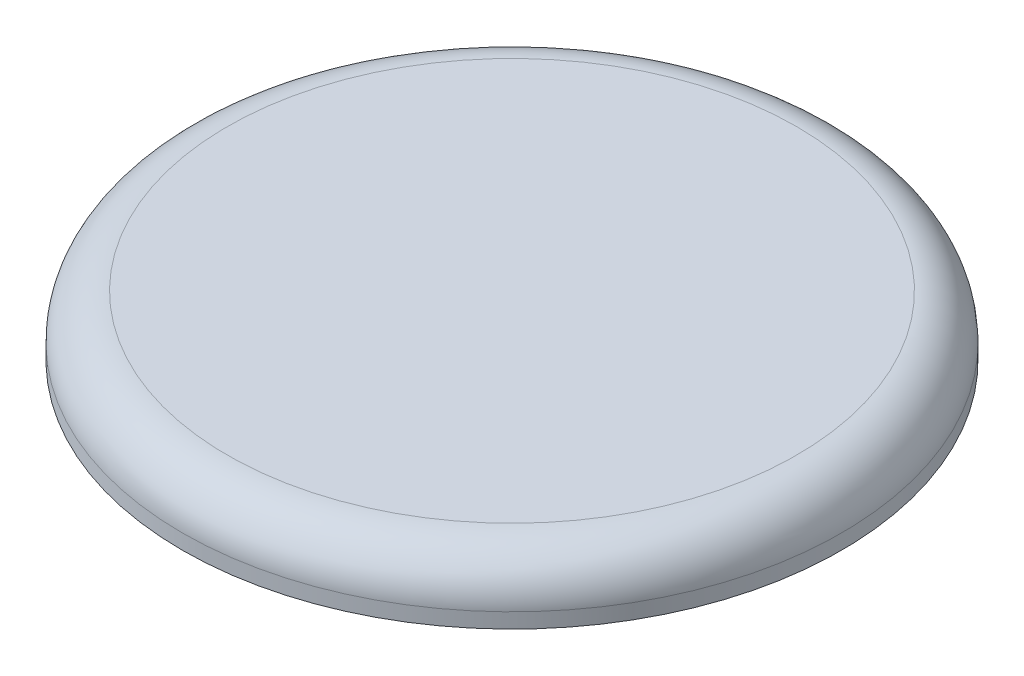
from build123d import *

# Parameters (mm, degrees)
CONG_1_R = 1.5
CONG_2_R = 0.5


with BuildPart() as part:
    # Esquisse1 → R_volution1 (revolve)
    with BuildSketch(Plane.XY, mode=Mode.PRIVATE) as r_volution1_sk:
        Polygon((0, 5.8), (11, 5.8), (11, 3.8), (5.5, 3.8), (5.5, 3.2), (4, 3.2), (4, 0), (0, 0), align=None)
    revolve(r_volution1_sk.sketch.rotate(Axis((0, 28.936170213, 0), (0, -1, 0)), 90), axis=Axis((0, 28.936170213, 0), (0, -1, 0)))

    # Cong_1
    cong_1_edges = [part.edges().sort_by_distance(p)[0] for p in [
        (0, 5.8, -11),
    ]]
    fillet(cong_1_edges, radius=CONG_1_R)

    # Cong_2
    cong_2_edges = [part.edges().sort_by_distance(p)[0] for p in [
        (0, 0, -4),
    ]]
    fillet(cong_2_edges, radius=CONG_2_R)


solid = part.part
